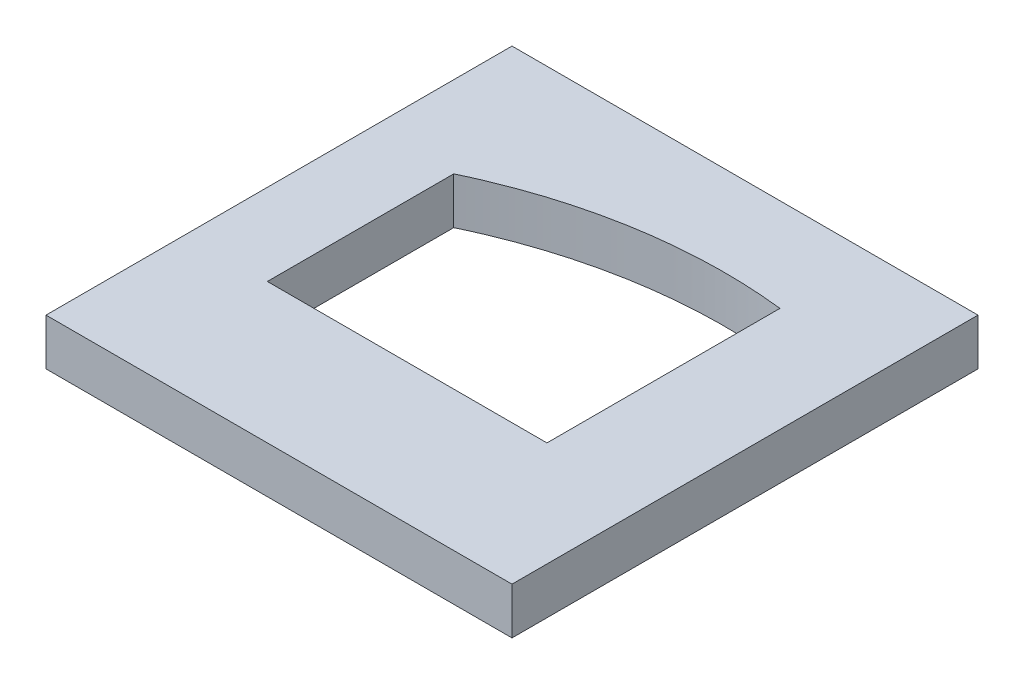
ISO-10303-21;
HEADER;
FILE_DESCRIPTION(('STEP AP214'),'2;1');
FILE_NAME('part.step','',(''),(''),'','','');
FILE_SCHEMA(('AUTOMOTIVE_DESIGN { 1 0 10303 214 1 1 1 1 }'));
ENDSEC;
DATA;
#1=APPLICATION_CONTEXT('core data for automotive mechanical design processes');
#2=APPLICATION_PROTOCOL_DEFINITION('international standard','automotive_design',2000,#1);
#3=PRODUCT_CONTEXT('',#1,'mechanical');
#4=PRODUCT('Part','Part','',(#3));
#5=PRODUCT_RELATED_PRODUCT_CATEGORY('part','',(#4));
#6=PRODUCT_DEFINITION_FORMATION('','',#4);
#7=PRODUCT_DEFINITION_CONTEXT('part definition',#1,'design');
#8=PRODUCT_DEFINITION('design','',#6,#7);
#9=PRODUCT_DEFINITION_SHAPE('','',#8);
#10=(LENGTH_UNIT() NAMED_UNIT(*) SI_UNIT(.MILLI.,.METRE.));
#11=(NAMED_UNIT(*) PLANE_ANGLE_UNIT() SI_UNIT($,.RADIAN.));
#12=(NAMED_UNIT(*) SI_UNIT($,.STERADIAN.) SOLID_ANGLE_UNIT());
#13=UNCERTAINTY_MEASURE_WITH_UNIT(LENGTH_MEASURE(1.E-05),#10,'distance_accuracy_value','');
#14=(GEOMETRIC_REPRESENTATION_CONTEXT(3) GLOBAL_UNCERTAINTY_ASSIGNED_CONTEXT((#13)) GLOBAL_UNIT_ASSIGNED_CONTEXT((#10,
#11,#12)) REPRESENTATION_CONTEXT('',''));
#15=CARTESIAN_POINT('',(0.,0.,0.));
#16=DIRECTION('',(0.,0.,1.));
#17=DIRECTION('',(1.,0.,0.));
#18=AXIS2_PLACEMENT_3D('',#15,#16,#17);
#19=CARTESIAN_POINT('',(0.,10.,0.));
#20=DIRECTION('',(0.,-1.,0.));
#21=DIRECTION('',(0.,0.,-1.));
#22=AXIS2_PLACEMENT_3D('',#19,#20,#21);
#23=PLANE('',#22);
#24=DIRECTION('',(0.,0.,-1.));
#25=VECTOR('',#24,1.);
#26=CARTESIAN_POINT('',(50.,10.,50.));
#27=LINE('',#26,#25);
#28=CARTESIAN_POINT('',(50.,10.,50.));
#29=VERTEX_POINT('',#28);
#30=CARTESIAN_POINT('',(50.,10.,-50.));
#31=VERTEX_POINT('',#30);
#32=EDGE_CURVE('E185',#29,#31,#27,.T.);
#33=ORIENTED_EDGE('',*,*,#32,.T.);
#34=DIRECTION('',(-1.,0.,0.));
#35=VECTOR('',#34,1.);
#36=CARTESIAN_POINT('',(-50.,10.,-50.));
#37=LINE('',#36,#35);
#38=CARTESIAN_POINT('',(-50.,10.,-50.));
#39=VERTEX_POINT('',#38);
#40=EDGE_CURVE('E188',#31,#39,#37,.T.);
#41=ORIENTED_EDGE('',*,*,#40,.T.);
#42=DIRECTION('',(0.,0.,1.));
#43=VECTOR('',#42,1.);
#44=CARTESIAN_POINT('',(-50.,10.,50.));
#45=LINE('',#44,#43);
#46=CARTESIAN_POINT('',(-50.,10.,50.));
#47=VERTEX_POINT('',#46);
#48=EDGE_CURVE('E191',#39,#47,#45,.T.);
#49=ORIENTED_EDGE('',*,*,#48,.T.);
#50=DIRECTION('',(1.,0.,0.));
#51=VECTOR('',#50,1.);
#52=CARTESIAN_POINT('',(-50.,10.,50.));
#53=LINE('',#52,#51);
#54=EDGE_CURVE('E193',#47,#29,#53,.T.);
#55=ORIENTED_EDGE('',*,*,#54,.T.);
#56=EDGE_LOOP('',(#33,#41,#49,#55));
#57=FACE_BOUND('',#56,.T.);
#58=DIRECTION('',(0.,0.,1.));
#59=VECTOR('',#58,1.);
#60=CARTESIAN_POINT('',(-32.5,10.,-5.37131519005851));
#61=LINE('',#60,#59);
#62=CARTESIAN_POINT('',(-32.5,10.,-20.));
#63=VERTEX_POINT('',#62);
#64=CARTESIAN_POINT('',(-32.5,10.,20.));
#65=VERTEX_POINT('',#64);
#66=EDGE_CURVE('E147',#63,#65,#61,.T.);
#67=ORIENTED_EDGE('',*,*,#66,.F.);
#68=CARTESIAN_POINT('',(27.5000000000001,10.,-30.));
#69=CARTESIAN_POINT('',(27.2918149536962,10.,-30.0229513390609));
#70=CARTESIAN_POINT('',(27.0836203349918,10.,-30.0458227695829));
#71=CARTESIAN_POINT('',(26.6671767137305,10.,-30.0911153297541));
#72=CARTESIAN_POINT('',(26.4589277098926,10.,-30.1135364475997));
#73=CARTESIAN_POINT('',(26.1464962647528,10.,-30.1466114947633));
#74=CARTESIAN_POINT('',(26.0423433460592,10.,-30.1575436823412));
#75=CARTESIAN_POINT('',(25.8340075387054,10.,-30.1791179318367));
#76=CARTESIAN_POINT('',(25.7298246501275,10.,-30.1897599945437));
#77=CARTESIAN_POINT('',(25.5214122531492,10.,-30.2105652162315));
#78=CARTESIAN_POINT('',(25.4171827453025,10.,-30.2207283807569));
#79=CARTESIAN_POINT('',(25.2086910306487,10.,-30.2407142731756));
#80=CARTESIAN_POINT('',(25.1044288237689,10.,-30.250537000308));
#81=CARTESIAN_POINT('',(24.7915920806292,10.,-30.2794820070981));
#82=CARTESIAN_POINT('',(24.5829689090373,10.,-30.2980809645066));
#83=CARTESIAN_POINT('',(24.165614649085,10.,-30.3340407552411));
#84=CARTESIAN_POINT('',(23.9568835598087,10.,-30.3514015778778));
#85=CARTESIAN_POINT('',(23.5393297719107,10.,-30.3849930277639));
#86=CARTESIAN_POINT('',(23.3305070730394,10.,-30.4012236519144));
#87=CARTESIAN_POINT('',(22.9127758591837,10.,-30.4325239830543));
#88=CARTESIAN_POINT('',(22.7038673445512,10.,-30.447593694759));
#89=CARTESIAN_POINT('',(22.0770142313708,10.,-30.4910548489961));
#90=CARTESIAN_POINT('',(21.6589463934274,10.,-30.5176979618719));
#91=CARTESIAN_POINT('',(21.0316419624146,10.,-30.554099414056));
#92=CARTESIAN_POINT('',(20.8225069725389,10.,-30.5656393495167));
#93=CARTESIAN_POINT('',(20.4041730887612,10.,-30.5874958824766));
#94=CARTESIAN_POINT('',(20.1949741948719,10.,-30.5978124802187));
#95=CARTESIAN_POINT('',(19.5672964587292,10.,-30.6269723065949));
#96=CARTESIAN_POINT('',(19.1487328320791,10.,-30.644025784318));
#97=CARTESIAN_POINT('',(18.3114358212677,10.,-30.6733781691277));
#98=CARTESIAN_POINT('',(17.8927024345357,10.,-30.6856770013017));
#99=CARTESIAN_POINT('',(16.6367274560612,10.,-30.7153946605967));
#100=CARTESIAN_POINT('',(15.7993018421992,10.,-30.7256536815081));
#101=CARTESIAN_POINT('',(14.124439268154,10.,-30.7270179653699));
#102=CARTESIAN_POINT('',(13.2870023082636,10.,-30.718122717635));
#103=CARTESIAN_POINT('',(10.7753891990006,10.,-30.6626317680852));
#104=CARTESIAN_POINT('',(9.10174478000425,10.,-30.5872348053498));
#105=CARTESIAN_POINT('',(5.9093151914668,10.,-30.3703876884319));
#106=CARTESIAN_POINT('',(4.39007543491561,10.,-30.2354526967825));
#107=CARTESIAN_POINT('',(1.35846201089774,10.,-29.9027225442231));
#108=CARTESIAN_POINT('',(-0.153911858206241,10.,-29.7049292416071));
#109=CARTESIAN_POINT('',(-2.41526802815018,10.,-29.3611114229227));
#110=CARTESIAN_POINT('',(-3.1679018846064,10.,-29.2386412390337));
#111=CARTESIAN_POINT('',(-4.67044621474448,10.,-28.9779988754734));
#112=CARTESIAN_POINT('',(-5.42035668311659,10.,-28.8398266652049));
#113=CARTESIAN_POINT('',(-7.66560075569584,10.,-28.4019488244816));
#114=CARTESIAN_POINT('',(-9.15645449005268,10.,-28.0788808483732));
#115=CARTESIAN_POINT('',(-11.8946026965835,10.,-27.4258227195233));
#116=CARTESIAN_POINT('',(-13.1440011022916,10.,-27.1045836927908));
#117=CARTESIAN_POINT('',(-15.6308511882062,10.,-26.4183921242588));
#118=CARTESIAN_POINT('',(-16.8683020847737,10.,-26.0534367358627));
#119=CARTESIAN_POINT('',(-19.329564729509,10.,-25.2800091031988));
#120=CARTESIAN_POINT('',(-20.553375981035,10.,-24.8715352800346));
#121=CARTESIAN_POINT('',(-22.9868712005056,10.,-24.0114574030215));
#122=CARTESIAN_POINT('',(-24.1965431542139,10.,-23.559819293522));
#123=CARTESIAN_POINT('',(-25.9985617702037,10.,-22.850791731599));
#124=CARTESIAN_POINT('',(-26.5971607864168,10.,-22.6091841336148));
#125=CARTESIAN_POINT('',(-27.4917789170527,10.,-22.2388680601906));
#126=CARTESIAN_POINT('',(-27.7894360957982,10.,-22.1141128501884));
#127=CARTESIAN_POINT('',(-28.3836608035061,10.,-21.8620355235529));
#128=CARTESIAN_POINT('',(-28.6802283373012,10.,-21.7347134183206));
#129=CARTESIAN_POINT('',(-29.1242091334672,10.,-21.5417420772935));
#130=CARTESIAN_POINT('',(-29.272055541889,10.,-21.4770878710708));
#131=CARTESIAN_POINT('',(-29.5674582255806,10.,-21.3471218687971));
#132=CARTESIAN_POINT('',(-29.7150145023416,10.,-21.2818100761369));
#133=CARTESIAN_POINT('',(-30.0098437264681,10.,-21.1505536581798));
#134=CARTESIAN_POINT('',(-30.1571166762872,10.,-21.0846090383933));
#135=CARTESIAN_POINT('',(-30.4513789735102,10.,-20.9520898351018));
#136=CARTESIAN_POINT('',(-30.5983683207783,10.,-20.8855152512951));
#137=CARTESIAN_POINT('',(-30.8920581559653,10.,-20.7517313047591));
#138=CARTESIAN_POINT('',(-31.0387586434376,10.,-20.6845219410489));
#139=CARTESIAN_POINT('',(-31.3318230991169,10.,-20.5493721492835));
#140=CARTESIAN_POINT('',(-31.4781870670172,10.,-20.481431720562));
#141=CARTESIAN_POINT('',(-31.6974287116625,10.,-20.3788694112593));
#142=CARTESIAN_POINT('',(-31.7704588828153,10.,-20.3445732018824));
#143=CARTESIAN_POINT('',(-31.9164634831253,10.,-20.2758621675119));
#144=CARTESIAN_POINT('',(-31.9894379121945,10.,-20.2414473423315));
#145=CARTESIAN_POINT('',(-32.1353560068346,10.,-20.1725529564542));
#146=CARTESIAN_POINT('',(-32.2082996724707,10.,-20.1380733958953));
#147=CARTESIAN_POINT('',(-32.3541645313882,10.,-20.0690674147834));
#148=CARTESIAN_POINT('',(-32.4270857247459,10.,-20.0345409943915));
#149=CARTESIAN_POINT('',(-32.5,10.,-20.));
#150=B_SPLINE_CURVE_WITH_KNOTS('',3,(#68,#69,#70,#71,#72,#73,#74,#75,#76,#77,#78,#79,#80,#81,
#82,#83,#84,#85,#86,#87,#88,#89,#90,#91,#92,#93,#94,#95,#96,#97,#98,#99,#100,#101,#102,#103,
#104,#105,#106,#107,#108,#109,#110,#111,#112,#113,#114,#115,#116,#117,#118,#119,#120,#121,#122,
#123,#124,#125,#126,#127,#128,#129,#130,#131,#132,#133,#134,#135,#136,#137,#138,#139,#140,#141,
#142,#143,#144,#145,#146,#147,#148,#149),.UNSPECIFIED.,.F.,.F.,(4,2,2,2,2,2,2,2,2,2,2,2,2,2,2,2,
2,2,2,2,2,2,2,2,2,2,2,2,2,2,2,2,2,2,2,2,2,2,2,2,4),(0.,0.628340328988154,1.25669710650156,
1.57087216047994,1.88504635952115,2.19921692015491,2.51338818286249,3.14173519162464,
3.77008762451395,4.39844178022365,5.02679338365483,6.28350962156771,6.91186614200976,
7.54022253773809,8.79692412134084,10.053645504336,12.5658596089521,15.0781406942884,
20.1022050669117,24.6766502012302,29.2509601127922,31.5384158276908,33.8258760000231,
38.400773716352,42.2701392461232,46.1397568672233,50.0095149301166,53.8823517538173,
55.818820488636,56.7870409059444,57.7552570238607,58.2393512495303,58.7234429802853,
59.2075304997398,59.6916182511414,60.1757067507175,60.6597956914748,60.9018424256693,
61.1438895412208,61.3859361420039,61.6279819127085),.UNSPECIFIED.);
#151=CARTESIAN_POINT('',(27.5000000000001,10.,-30.));
#152=VERTEX_POINT('',#151);
#153=EDGE_CURVE('E178',#152,#63,#150,.T.);
#154=ORIENTED_EDGE('',*,*,#153,.F.);
#155=DIRECTION('',(0.,0.,1.));
#156=VECTOR('',#155,1.);
#157=CARTESIAN_POINT('',(27.5,10.,-5.37131519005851));
#158=LINE('',#157,#156);
#159=CARTESIAN_POINT('',(27.5,10.,20.));
#160=VERTEX_POINT('',#159);
#161=EDGE_CURVE('E184',#160,#152,#158,.F.);
#162=ORIENTED_EDGE('',*,*,#161,.F.);
#163=DIRECTION('',(1.,0.,0.));
#164=VECTOR('',#163,1.);
#165=CARTESIAN_POINT('',(-2.49999999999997,10.,20.));
#166=LINE('',#165,#164);
#167=EDGE_CURVE('E265',#65,#160,#166,.T.);
#168=ORIENTED_EDGE('',*,*,#167,.F.);
#169=EDGE_LOOP('',(#67,#154,#162,#168));
#170=FACE_BOUND('',#169,.T.);
#171=ADVANCED_FACE('F66',(#57,#170),#23,.F.);
#172=CARTESIAN_POINT('',(0.,0.,0.));
#173=DIRECTION('',(0.,-1.,0.));
#174=DIRECTION('',(0.,0.,-1.));
#175=AXIS2_PLACEMENT_3D('',#172,#173,#174);
#176=PLANE('',#175);
#177=DIRECTION('',(0.,0.,-1.));
#178=VECTOR('',#177,1.);
#179=CARTESIAN_POINT('',(50.,0.,50.));
#180=LINE('',#179,#178);
#181=CARTESIAN_POINT('',(50.,0.,50.));
#182=VERTEX_POINT('',#181);
#183=CARTESIAN_POINT('',(50.,0.,-50.));
#184=VERTEX_POINT('',#183);
#185=EDGE_CURVE('E196',#182,#184,#180,.T.);
#186=ORIENTED_EDGE('',*,*,#185,.F.);
#187=DIRECTION('',(1.,0.,0.));
#188=VECTOR('',#187,1.);
#189=CARTESIAN_POINT('',(-50.,0.,50.));
#190=LINE('',#189,#188);
#191=CARTESIAN_POINT('',(-50.,0.,50.));
#192=VERTEX_POINT('',#191);
#193=EDGE_CURVE('E189',#192,#182,#190,.T.);
#194=ORIENTED_EDGE('',*,*,#193,.F.);
#195=DIRECTION('',(0.,0.,1.));
#196=VECTOR('',#195,1.);
#197=CARTESIAN_POINT('',(-50.,0.,50.));
#198=LINE('',#197,#196);
#199=CARTESIAN_POINT('',(-50.,0.,-50.));
#200=VERTEX_POINT('',#199);
#201=EDGE_CURVE('E201',#200,#192,#198,.T.);
#202=ORIENTED_EDGE('',*,*,#201,.F.);
#203=DIRECTION('',(-1.,0.,0.));
#204=VECTOR('',#203,1.);
#205=CARTESIAN_POINT('',(-50.,0.,-50.));
#206=LINE('',#205,#204);
#207=EDGE_CURVE('E199',#184,#200,#206,.T.);
#208=ORIENTED_EDGE('',*,*,#207,.F.);
#209=EDGE_LOOP('',(#186,#194,#202,#208));
#210=FACE_BOUND('',#209,.T.);
#211=CARTESIAN_POINT('',(27.5000000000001,0.,-30.));
#212=CARTESIAN_POINT('',(27.2918149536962,0.,-30.0229513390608));
#213=CARTESIAN_POINT('',(27.0836203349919,0.,-30.0458227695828));
#214=CARTESIAN_POINT('',(26.6671767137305,0.,-30.0911153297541));
#215=CARTESIAN_POINT('',(26.4589277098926,0.,-30.1135364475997));
#216=CARTESIAN_POINT('',(26.1464962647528,0.,-30.1466114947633));
#217=CARTESIAN_POINT('',(26.0423433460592,0.,-30.1575436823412));
#218=CARTESIAN_POINT('',(25.8340075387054,0.,-30.1791179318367));
#219=CARTESIAN_POINT('',(25.7298246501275,0.,-30.1897599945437));
#220=CARTESIAN_POINT('',(25.5214122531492,0.,-30.2105652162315));
#221=CARTESIAN_POINT('',(25.4171827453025,0.,-30.2207283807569));
#222=CARTESIAN_POINT('',(25.2086910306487,0.,-30.2407142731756));
#223=CARTESIAN_POINT('',(25.1044288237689,0.,-30.250537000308));
#224=CARTESIAN_POINT('',(24.7915920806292,0.,-30.2794820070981));
#225=CARTESIAN_POINT('',(24.5829689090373,0.,-30.2980809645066));
#226=CARTESIAN_POINT('',(24.1656146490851,0.,-30.3340407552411));
#227=CARTESIAN_POINT('',(23.9568835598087,0.,-30.3514015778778));
#228=CARTESIAN_POINT('',(23.5393297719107,0.,-30.3849930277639));
#229=CARTESIAN_POINT('',(23.3305070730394,0.,-30.4012236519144));
#230=CARTESIAN_POINT('',(22.9127758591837,0.,-30.4325239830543));
#231=CARTESIAN_POINT('',(22.7038673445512,0.,-30.447593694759));
#232=CARTESIAN_POINT('',(22.0770142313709,0.,-30.4910548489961));
#233=CARTESIAN_POINT('',(21.6589463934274,0.,-30.5176979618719));
#234=CARTESIAN_POINT('',(21.0316419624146,0.,-30.554099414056));
#235=CARTESIAN_POINT('',(20.8225069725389,0.,-30.5656393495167));
#236=CARTESIAN_POINT('',(20.4041730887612,0.,-30.5874958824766));
#237=CARTESIAN_POINT('',(20.1949741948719,0.,-30.5978124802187));
#238=CARTESIAN_POINT('',(19.5672964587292,0.,-30.6269723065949));
#239=CARTESIAN_POINT('',(19.1487328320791,0.,-30.644025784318));
#240=CARTESIAN_POINT('',(18.3114358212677,0.,-30.6733781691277));
#241=CARTESIAN_POINT('',(17.8927024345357,0.,-30.6856770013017));
#242=CARTESIAN_POINT('',(16.6367274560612,0.,-30.7153946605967));
#243=CARTESIAN_POINT('',(15.7993018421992,0.,-30.7256536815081));
#244=CARTESIAN_POINT('',(14.124439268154,0.,-30.7270179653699));
#245=CARTESIAN_POINT('',(13.2870023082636,0.,-30.718122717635));
#246=CARTESIAN_POINT('',(10.7753891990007,0.,-30.6626317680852));
#247=CARTESIAN_POINT('',(9.10174478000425,0.,-30.5872348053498));
#248=CARTESIAN_POINT('',(5.9093151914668,0.,-30.3703876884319));
#249=CARTESIAN_POINT('',(4.39007543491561,0.,-30.2354526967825));
#250=CARTESIAN_POINT('',(1.35846201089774,0.,-29.9027225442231));
#251=CARTESIAN_POINT('',(-0.153911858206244,0.,-29.7049292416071));
#252=CARTESIAN_POINT('',(-2.41526802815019,0.,-29.3611114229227));
#253=CARTESIAN_POINT('',(-3.1679018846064,0.,-29.2386412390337));
#254=CARTESIAN_POINT('',(-4.67044621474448,0.,-28.9779988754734));
#255=CARTESIAN_POINT('',(-5.42035668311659,0.,-28.8398266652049));
#256=CARTESIAN_POINT('',(-7.66560075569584,0.,-28.4019488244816));
#257=CARTESIAN_POINT('',(-9.15645449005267,0.,-28.0788808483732));
#258=CARTESIAN_POINT('',(-11.8946026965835,0.,-27.4258227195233));
#259=CARTESIAN_POINT('',(-13.1440011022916,0.,-27.1045836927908));
#260=CARTESIAN_POINT('',(-15.6308511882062,0.,-26.4183921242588));
#261=CARTESIAN_POINT('',(-16.8683020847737,0.,-26.0534367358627));
#262=CARTESIAN_POINT('',(-19.329564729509,0.,-25.2800091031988));
#263=CARTESIAN_POINT('',(-20.553375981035,0.,-24.8715352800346));
#264=CARTESIAN_POINT('',(-22.9868712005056,0.,-24.0114574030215));
#265=CARTESIAN_POINT('',(-24.1965431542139,0.,-23.559819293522));
#266=CARTESIAN_POINT('',(-25.9985617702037,0.,-22.850791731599));
#267=CARTESIAN_POINT('',(-26.5971607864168,0.,-22.6091841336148));
#268=CARTESIAN_POINT('',(-27.4917789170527,0.,-22.2388680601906));
#269=CARTESIAN_POINT('',(-27.7894360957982,0.,-22.1141128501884));
#270=CARTESIAN_POINT('',(-28.3836608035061,0.,-21.8620355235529));
#271=CARTESIAN_POINT('',(-28.6802283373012,0.,-21.7347134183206));
#272=CARTESIAN_POINT('',(-29.1242091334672,0.,-21.5417420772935));
#273=CARTESIAN_POINT('',(-29.272055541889,0.,-21.4770878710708));
#274=CARTESIAN_POINT('',(-29.5674582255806,0.,-21.3471218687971));
#275=CARTESIAN_POINT('',(-29.7150145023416,0.,-21.2818100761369));
#276=CARTESIAN_POINT('',(-30.0098437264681,0.,-21.1505536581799));
#277=CARTESIAN_POINT('',(-30.1571166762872,0.,-21.0846090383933));
#278=CARTESIAN_POINT('',(-30.4513789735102,0.,-20.9520898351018));
#279=CARTESIAN_POINT('',(-30.5983683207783,0.,-20.8855152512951));
#280=CARTESIAN_POINT('',(-30.8920581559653,0.,-20.7517313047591));
#281=CARTESIAN_POINT('',(-31.0387586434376,0.,-20.6845219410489));
#282=CARTESIAN_POINT('',(-31.3318230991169,0.,-20.5493721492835));
#283=CARTESIAN_POINT('',(-31.4781870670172,0.,-20.481431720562));
#284=CARTESIAN_POINT('',(-31.6974287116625,0.,-20.3788694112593));
#285=CARTESIAN_POINT('',(-31.7704588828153,0.,-20.3445732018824));
#286=CARTESIAN_POINT('',(-31.9164634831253,0.,-20.2758621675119));
#287=CARTESIAN_POINT('',(-31.9894379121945,0.,-20.2414473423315));
#288=CARTESIAN_POINT('',(-32.1353560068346,0.,-20.1725529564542));
#289=CARTESIAN_POINT('',(-32.2082996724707,0.,-20.1380733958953));
#290=CARTESIAN_POINT('',(-32.3541645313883,0.,-20.0690674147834));
#291=CARTESIAN_POINT('',(-32.4270857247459,0.,-20.0345409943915));
#292=CARTESIAN_POINT('',(-32.5,0.,-20.));
#293=B_SPLINE_CURVE_WITH_KNOTS('',3,(#211,#212,#213,#214,#215,#216,#217,#218,#219,#220,#221,
#222,#223,#224,#225,#226,#227,#228,#229,#230,#231,#232,#233,#234,#235,#236,#237,#238,#239,#240,
#241,#242,#243,#244,#245,#246,#247,#248,#249,#250,#251,#252,#253,#254,#255,#256,#257,#258,#259,
#260,#261,#262,#263,#264,#265,#266,#267,#268,#269,#270,#271,#272,#273,#274,#275,#276,#277,#278,
#279,#280,#281,#282,#283,#284,#285,#286,#287,#288,#289,#290,#291,#292),.UNSPECIFIED.,.F.,.F.,(4,
2,2,2,2,2,2,2,2,2,2,2,2,2,2,2,2,2,2,2,2,2,2,2,2,2,2,2,2,2,2,2,2,2,2,2,2,2,2,2,4),(0.,
0.628340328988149,1.25669710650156,1.57087216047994,1.88504635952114,2.1992169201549,
2.51338818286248,3.14173519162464,3.77008762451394,4.39844178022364,5.02679338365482,
6.2835096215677,6.91186614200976,7.54022253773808,8.79692412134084,10.053645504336,
12.5658596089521,15.0781406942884,20.1022050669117,24.6766502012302,29.2509601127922,
31.5384158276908,33.8258760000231,38.400773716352,42.2701392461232,46.1397568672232,
50.0095149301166,53.8823517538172,55.8188204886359,56.7870409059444,57.7552570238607,
58.2393512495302,58.7234429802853,59.2075304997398,59.6916182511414,60.1757067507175,
60.6597956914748,60.9018424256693,61.1438895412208,61.3859361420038,61.6279819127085),.UNSPECIFIED.);
#294=CARTESIAN_POINT('',(27.5,0.,-30.));
#295=VERTEX_POINT('',#294);
#296=CARTESIAN_POINT('',(-32.5,0.,-20.));
#297=VERTEX_POINT('',#296);
#298=EDGE_CURVE('E150',#295,#297,#293,.T.);
#299=ORIENTED_EDGE('',*,*,#298,.T.);
#300=DIRECTION('',(0.,0.,1.));
#301=VECTOR('',#300,1.);
#302=CARTESIAN_POINT('',(-32.5,0.,20.));
#303=LINE('',#302,#301);
#304=CARTESIAN_POINT('',(-32.5,0.,20.));
#305=VERTEX_POINT('',#304);
#306=EDGE_CURVE('E141',#297,#305,#303,.T.);
#307=ORIENTED_EDGE('',*,*,#306,.T.);
#308=DIRECTION('',(1.,0.,0.));
#309=VECTOR('',#308,1.);
#310=CARTESIAN_POINT('',(27.5,0.,20.));
#311=LINE('',#310,#309);
#312=CARTESIAN_POINT('',(27.5,0.,20.));
#313=VERTEX_POINT('',#312);
#314=EDGE_CURVE('E131',#305,#313,#311,.T.);
#315=ORIENTED_EDGE('',*,*,#314,.T.);
#316=DIRECTION('',(0.,0.,-1.));
#317=VECTOR('',#316,1.);
#318=CARTESIAN_POINT('',(27.5,0.,20.));
#319=LINE('',#318,#317);
#320=EDGE_CURVE('E152',#313,#295,#319,.T.);
#321=ORIENTED_EDGE('',*,*,#320,.T.);
#322=EDGE_LOOP('',(#299,#307,#315,#321));
#323=FACE_BOUND('',#322,.T.);
#324=ADVANCED_FACE('F149',(#210,#323),#176,.T.);
#325=CARTESIAN_POINT('',(50.,10.,50.));
#326=DIRECTION('',(-1.,0.,0.));
#327=DIRECTION('',(0.,0.,1.));
#328=AXIS2_PLACEMENT_3D('',#325,#326,#327);
#329=PLANE('',#328);
#330=ORIENTED_EDGE('',*,*,#185,.T.);
#331=DIRECTION('',(0.,-1.,0.));
#332=VECTOR('',#331,1.);
#333=CARTESIAN_POINT('',(50.,10.,-50.));
#334=LINE('',#333,#332);
#335=EDGE_CURVE('E12',#31,#184,#334,.T.);
#336=ORIENTED_EDGE('',*,*,#335,.F.);
#337=ORIENTED_EDGE('',*,*,#32,.F.);
#338=DIRECTION('',(0.,-1.,0.));
#339=VECTOR('',#338,1.);
#340=CARTESIAN_POINT('',(50.,10.,50.));
#341=LINE('',#340,#339);
#342=EDGE_CURVE('E195',#29,#182,#341,.T.);
#343=ORIENTED_EDGE('',*,*,#342,.T.);
#344=EDGE_LOOP('',(#330,#336,#337,#343));
#345=FACE_BOUND('',#344,.T.);
#346=ADVANCED_FACE('F68',(#345),#329,.F.);
#347=CARTESIAN_POINT('',(-50.,10.,-50.));
#348=DIRECTION('',(0.,0.,1.));
#349=DIRECTION('',(1.,0.,0.));
#350=AXIS2_PLACEMENT_3D('',#347,#348,#349);
#351=PLANE('',#350);
#352=ORIENTED_EDGE('',*,*,#207,.T.);
#353=DIRECTION('',(0.,-1.,0.));
#354=VECTOR('',#353,1.);
#355=CARTESIAN_POINT('',(-50.,10.,-50.));
#356=LINE('',#355,#354);
#357=EDGE_CURVE('E74',#39,#200,#356,.T.);
#358=ORIENTED_EDGE('',*,*,#357,.F.);
#359=ORIENTED_EDGE('',*,*,#40,.F.);
#360=ORIENTED_EDGE('',*,*,#335,.T.);
#361=EDGE_LOOP('',(#352,#358,#359,#360));
#362=FACE_BOUND('',#361,.T.);
#363=ADVANCED_FACE('F228',(#362),#351,.F.);
#364=CARTESIAN_POINT('',(-50.,10.,50.));
#365=DIRECTION('',(1.,0.,0.));
#366=DIRECTION('',(0.,0.,-1.));
#367=AXIS2_PLACEMENT_3D('',#364,#365,#366);
#368=PLANE('',#367);
#369=ORIENTED_EDGE('',*,*,#201,.T.);
#370=DIRECTION('',(0.,-1.,0.));
#371=VECTOR('',#370,1.);
#372=CARTESIAN_POINT('',(-50.,10.,50.));
#373=LINE('',#372,#371);
#374=EDGE_CURVE('E206',#47,#192,#373,.T.);
#375=ORIENTED_EDGE('',*,*,#374,.F.);
#376=ORIENTED_EDGE('',*,*,#48,.F.);
#377=ORIENTED_EDGE('',*,*,#357,.T.);
#378=EDGE_LOOP('',(#369,#375,#376,#377));
#379=FACE_BOUND('',#378,.T.);
#380=ADVANCED_FACE('F213',(#379),#368,.F.);
#381=CARTESIAN_POINT('',(-50.,10.,50.));
#382=DIRECTION('',(0.,0.,-1.));
#383=DIRECTION('',(-1.,0.,0.));
#384=AXIS2_PLACEMENT_3D('',#381,#382,#383);
#385=PLANE('',#384);
#386=ORIENTED_EDGE('',*,*,#193,.T.);
#387=ORIENTED_EDGE('',*,*,#342,.F.);
#388=ORIENTED_EDGE('',*,*,#54,.F.);
#389=ORIENTED_EDGE('',*,*,#374,.T.);
#390=EDGE_LOOP('',(#386,#387,#388,#389));
#391=FACE_BOUND('',#390,.T.);
#392=ADVANCED_FACE('F221',(#391),#385,.F.);
#393=CARTESIAN_POINT('',(-32.5,0.,-20.));
#394=CARTESIAN_POINT('',(-32.5,0.,-6.66666666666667));
#395=CARTESIAN_POINT('',(-32.5,0.,6.66666666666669));
#396=CARTESIAN_POINT('',(-32.5,0.,20.));
#397=CARTESIAN_POINT('',(-32.5,10.,-20.));
#398=CARTESIAN_POINT('',(-32.5,10.,-6.66666666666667));
#399=CARTESIAN_POINT('',(-32.5,10.,6.66666666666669));
#400=CARTESIAN_POINT('',(-32.5,10.,20.));
#401=B_SPLINE_SURFACE_WITH_KNOTS('',1,3,((#393,#394,#395,#396),(#397,#398,#399,#400)),
.UNSPECIFIED.,.F.,.F.,.F.,(2,2),(4,4),(0.,1.),(0.,1.),.UNSPECIFIED.);
#402=DIRECTION('',(0.,-1.,0.));
#403=VECTOR('',#402,1.);
#404=CARTESIAN_POINT('',(-32.5,5.,-20.));
#405=LINE('',#404,#403);
#406=EDGE_CURVE('E86',#63,#297,#405,.T.);
#407=DIRECTION('',(0.,1.,0.));
#408=VECTOR('',#407,1.);
#409=CARTESIAN_POINT('',(-32.5,0.,20.));
#410=LINE('',#409,#408);
#411=EDGE_CURVE('E134',#65,#305,#410,.F.);
#412=ORIENTED_EDGE('',*,*,#406,.F.);
#413=ORIENTED_EDGE('',*,*,#66,.T.);
#414=ORIENTED_EDGE('',*,*,#411,.T.);
#415=ORIENTED_EDGE('',*,*,#306,.F.);
#416=EDGE_LOOP('',(#412,#413,#414,#415));
#417=FACE_BOUND('',#416,.T.);
#418=ADVANCED_FACE('F144',(#417),#401,.T.);
#419=CARTESIAN_POINT('',(27.5,0.,20.));
#420=DIRECTION('',(0.,0.,1.));
#421=DIRECTION('',(1.,0.,0.));
#422=AXIS2_PLACEMENT_3D('',#419,#420,#421);
#423=PLANE('',#422);
#424=ORIENTED_EDGE('',*,*,#411,.F.);
#425=ORIENTED_EDGE('',*,*,#167,.T.);
#426=DIRECTION('',(0.,1.,0.));
#427=VECTOR('',#426,1.);
#428=CARTESIAN_POINT('',(27.5,0.,20.));
#429=LINE('',#428,#427);
#430=EDGE_CURVE('E137',#160,#313,#429,.F.);
#431=ORIENTED_EDGE('',*,*,#430,.T.);
#432=ORIENTED_EDGE('',*,*,#314,.F.);
#433=EDGE_LOOP('',(#424,#425,#431,#432));
#434=FACE_BOUND('',#433,.T.);
#435=ADVANCED_FACE('F133',(#434),#423,.F.);
#436=CARTESIAN_POINT('',(27.5,0.,20.));
#437=DIRECTION('',(1.,0.,0.));
#438=DIRECTION('',(0.,0.,-1.));
#439=AXIS2_PLACEMENT_3D('',#436,#437,#438);
#440=PLANE('',#439);
#441=ORIENTED_EDGE('',*,*,#430,.F.);
#442=ORIENTED_EDGE('',*,*,#161,.T.);
#443=DIRECTION('',(0.,1.,0.));
#444=VECTOR('',#443,1.);
#445=CARTESIAN_POINT('',(27.5,0.,-30.));
#446=LINE('',#445,#444);
#447=EDGE_CURVE('E81',#152,#295,#446,.F.);
#448=ORIENTED_EDGE('',*,*,#447,.T.);
#449=ORIENTED_EDGE('',*,*,#320,.F.);
#450=EDGE_LOOP('',(#441,#442,#448,#449));
#451=FACE_BOUND('',#450,.T.);
#452=ADVANCED_FACE('F176',(#451),#440,.F.);
#453=CARTESIAN_POINT('',(27.5000000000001,0.,-30.));
#454=CARTESIAN_POINT('',(27.0747616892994,0.,-30.0469533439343));
#455=CARTESIAN_POINT('',(26.7025639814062,0.,-30.0874460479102));
#456=CARTESIAN_POINT('',(26.2238283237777,0.,-30.1384941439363));
#457=CARTESIAN_POINT('',(26.0775099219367,0.,-30.1538950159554));
#458=CARTESIAN_POINT('',(25.8779225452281,0.,-30.1745735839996));
#459=CARTESIAN_POINT('',(25.8147084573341,0.,-30.1810626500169));
#460=CARTESIAN_POINT('',(25.7248598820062,0.,-30.1901905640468));
#461=CARTESIAN_POINT('',(25.6957391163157,0.,-30.1931322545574));
#462=CARTESIAN_POINT('',(25.6391551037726,0.,-30.1988137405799));
#463=CARTESIAN_POINT('',(25.6228702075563,0.,-30.2004460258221));
#464=CARTESIAN_POINT('',(25.2825546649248,0.,-30.2341632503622));
#465=CARTESIAN_POINT('',(24.9714503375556,0.,-30.2633584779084));
#466=CARTESIAN_POINT('',(24.49189141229,0.,-30.3059878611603));
#467=CARTESIAN_POINT('',(24.3298880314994,0.,-30.3200037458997));
#468=CARTESIAN_POINT('',(24.0015804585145,0.,-30.3476476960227));
#469=CARTESIAN_POINT('',(23.8283616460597,0.,-30.3618271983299));
#470=CARTESIAN_POINT('',(23.0206617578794,0.,-30.4262407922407));
#471=CARTESIAN_POINT('',(22.3772527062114,0.,-30.4720284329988));
#472=CARTESIAN_POINT('',(21.0959363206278,0.,-30.5521172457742));
#473=CARTESIAN_POINT('',(20.4654775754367,0.,-30.5860835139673));
#474=CARTESIAN_POINT('',(17.2524522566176,0.,-30.7305477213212));
#475=CARTESIAN_POINT('',(14.6863332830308,0.,-30.7562089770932));
#476=CARTESIAN_POINT('',(6.99105593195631,0.,-30.5632160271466));
#477=CARTESIAN_POINT('',(1.85610931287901,0.,-30.0732700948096));
#478=CARTESIAN_POINT('',(-8.26610023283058,0.,-28.386285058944));
#479=CARTESIAN_POINT('',(-13.2829128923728,0.,-27.1840960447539));
#480=CARTESIAN_POINT('',(-20.6240125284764,0.,-24.8712006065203));
#481=CARTESIAN_POINT('',(-23.0472160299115,0.,-24.0131315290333));
#482=CARTESIAN_POINT('',(-26.0349030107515,0.,-22.8362073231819));
#483=CARTESIAN_POINT('',(-26.6301898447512,0.,-22.5956860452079));
#484=CARTESIAN_POINT('',(-27.8162623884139,0.,-22.1043706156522));
#485=CARTESIAN_POINT('',(-28.4150547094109,0.,-21.8500947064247));
#486=CARTESIAN_POINT('',(-29.2858475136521,0.,-21.4714214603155));
#487=CARTESIAN_POINT('',(-29.5775830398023,0.,-21.3430259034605));
#488=CARTESIAN_POINT('',(-30.1639966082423,0.,-21.0818925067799));
#489=CARTESIAN_POINT('',(-30.453151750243,0.,-20.9516705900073));
#490=CARTESIAN_POINT('',(-30.9056600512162,0.,-20.7455332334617));
#491=CARTESIAN_POINT('',(-31.0539373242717,0.,-20.6775580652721));
#492=CARTESIAN_POINT('',(-31.2725149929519,0.,-20.5767012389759));
#493=CARTESIAN_POINT('',(-31.3447345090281,0.,-20.5432666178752));
#494=CARTESIAN_POINT('',(-31.4521042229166,0.,-20.4933911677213));
#495=CARTESIAN_POINT('',(-31.4877342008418,0.,-20.4768120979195));
#496=CARTESIAN_POINT('',(-31.5409392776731,0.,-20.4520126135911));
#497=CARTESIAN_POINT('',(-31.5586343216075,0.,-20.4437576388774));
#498=CARTESIAN_POINT('',(-31.5939444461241,0.,-20.4272707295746));
#499=CARTESIAN_POINT('',(-31.6170345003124,0.,-20.4164779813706));
#500=CARTESIAN_POINT('',(-31.8227366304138,0.,-20.3202647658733));
#501=CARTESIAN_POINT('',(-32.113025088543,0.,-20.1833253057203));
#502=CARTESIAN_POINT('',(-32.5,0.,-20.));
#503=CARTESIAN_POINT('',(27.5000000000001,10.,-30.));
#504=CARTESIAN_POINT('',(27.0747616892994,10.,-30.0469533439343));
#505=CARTESIAN_POINT('',(26.7025639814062,10.,-30.0874460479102));
#506=CARTESIAN_POINT('',(26.2238283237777,10.,-30.1384941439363));
#507=CARTESIAN_POINT('',(26.0775099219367,10.,-30.1538950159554));
#508=CARTESIAN_POINT('',(25.8779225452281,10.,-30.1745735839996));
#509=CARTESIAN_POINT('',(25.8147084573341,10.,-30.1810626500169));
#510=CARTESIAN_POINT('',(25.7248598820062,10.,-30.1901905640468));
#511=CARTESIAN_POINT('',(25.6957391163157,10.,-30.1931322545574));
#512=CARTESIAN_POINT('',(25.6391551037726,10.,-30.1988137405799));
#513=CARTESIAN_POINT('',(25.6228702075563,10.,-30.2004460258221));
#514=CARTESIAN_POINT('',(25.2825546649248,10.,-30.2341632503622));
#515=CARTESIAN_POINT('',(24.9714503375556,10.,-30.2633584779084));
#516=CARTESIAN_POINT('',(24.49189141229,10.,-30.3059878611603));
#517=CARTESIAN_POINT('',(24.3298880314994,10.,-30.3200037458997));
#518=CARTESIAN_POINT('',(24.0015804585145,10.,-30.3476476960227));
#519=CARTESIAN_POINT('',(23.8283616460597,10.,-30.3618271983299));
#520=CARTESIAN_POINT('',(23.0206617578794,10.,-30.4262407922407));
#521=CARTESIAN_POINT('',(22.3772527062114,10.,-30.4720284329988));
#522=CARTESIAN_POINT('',(21.0959363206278,10.,-30.5521172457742));
#523=CARTESIAN_POINT('',(20.4654775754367,10.,-30.5860835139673));
#524=CARTESIAN_POINT('',(17.2524522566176,10.,-30.7305477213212));
#525=CARTESIAN_POINT('',(14.6863332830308,10.,-30.7562089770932));
#526=CARTESIAN_POINT('',(6.99105593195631,10.,-30.5632160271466));
#527=CARTESIAN_POINT('',(1.85610931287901,10.,-30.0732700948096));
#528=CARTESIAN_POINT('',(-8.26610023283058,10.,-28.386285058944));
#529=CARTESIAN_POINT('',(-13.2829128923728,10.,-27.1840960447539));
#530=CARTESIAN_POINT('',(-20.6240125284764,10.,-24.8712006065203));
#531=CARTESIAN_POINT('',(-23.0472160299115,10.,-24.0131315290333));
#532=CARTESIAN_POINT('',(-26.0349030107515,10.,-22.8362073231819));
#533=CARTESIAN_POINT('',(-26.6301898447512,10.,-22.5956860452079));
#534=CARTESIAN_POINT('',(-27.8162623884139,10.,-22.1043706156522));
#535=CARTESIAN_POINT('',(-28.4150547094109,10.,-21.8500947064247));
#536=CARTESIAN_POINT('',(-29.2858475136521,10.,-21.4714214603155));
#537=CARTESIAN_POINT('',(-29.5775830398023,10.,-21.3430259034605));
#538=CARTESIAN_POINT('',(-30.1639966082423,10.,-21.0818925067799));
#539=CARTESIAN_POINT('',(-30.453151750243,10.,-20.9516705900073));
#540=CARTESIAN_POINT('',(-30.9056600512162,10.,-20.7455332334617));
#541=CARTESIAN_POINT('',(-31.0539373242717,10.,-20.6775580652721));
#542=CARTESIAN_POINT('',(-31.2725149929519,10.,-20.5767012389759));
#543=CARTESIAN_POINT('',(-31.3447345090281,10.,-20.5432666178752));
#544=CARTESIAN_POINT('',(-31.4521042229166,10.,-20.4933911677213));
#545=CARTESIAN_POINT('',(-31.4877342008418,10.,-20.4768120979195));
#546=CARTESIAN_POINT('',(-31.5409392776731,10.,-20.4520126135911));
#547=CARTESIAN_POINT('',(-31.5586343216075,10.,-20.4437576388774));
#548=CARTESIAN_POINT('',(-31.5939444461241,10.,-20.4272707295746));
#549=CARTESIAN_POINT('',(-31.6170345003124,10.,-20.4164779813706));
#550=CARTESIAN_POINT('',(-31.8227366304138,10.,-20.3202647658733));
#551=CARTESIAN_POINT('',(-32.113025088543,10.,-20.1833253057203));
#552=CARTESIAN_POINT('',(-32.5,10.,-20.));
#553=B_SPLINE_SURFACE_WITH_KNOTS('',1,3,((#453,#454,#455,#456,#457,#458,#459,#460,#461,#462,
#463,#464,#465,#466,#467,#468,#469,#470,#471,#472,#473,#474,#475,#476,#477,#478,#479,#480,#481,
#482,#483,#484,#485,#486,#487,#488,#489,#490,#491,#492,#493,#494,#495,#496,#497,#498,#499,#500,
#501,#502),(#503,#504,#505,#506,#507,#508,#509,#510,#511,#512,#513,#514,#515,#516,#517,#518,
#519,#520,#521,#522,#523,#524,#525,#526,#527,#528,#529,#530,#531,#532,#533,#534,#535,#536,#537,
#538,#539,#540,#541,#542,#543,#544,#545,#546,#547,#548,#549,#550,#551,#552)),.UNSPECIFIED.,.F.,
.F.,.F.,(2,2),(4,2,2,2,2,2,2,2,2,2,2,2,2,2,2,2,2,2,2,2,2,2,2,2,4),(0.,1.),(0.,0.015625,
0.0234375,0.02734375,0.029296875,0.03125,0.046875,0.0546875,0.0625,0.09375,0.125,0.25,0.5,0.75,
0.875,0.90625,0.9375,0.953125,0.96875,0.9765625,0.98046875,0.982421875,0.9833984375,0.984375,
1.),.UNSPECIFIED.);
#554=ORIENTED_EDGE('',*,*,#153,.T.);
#555=ORIENTED_EDGE('',*,*,#406,.T.);
#556=ORIENTED_EDGE('',*,*,#298,.F.);
#557=ORIENTED_EDGE('',*,*,#447,.F.);
#558=EDGE_LOOP('',(#554,#555,#556,#557));
#559=FACE_BOUND('',#558,.T.);
#560=ADVANCED_FACE('F166',(#559),#553,.T.);
#561=CLOSED_SHELL('',(#171,#324,#346,#363,#380,#392,#418,#435,#452,#560));
#562=MANIFOLD_SOLID_BREP('B2',#561);
#563=ADVANCED_BREP_SHAPE_REPRESENTATION('',(#18,#562),#14);
#564=SHAPE_DEFINITION_REPRESENTATION(#9,#563);
ENDSEC;
END-ISO-10303-21;
